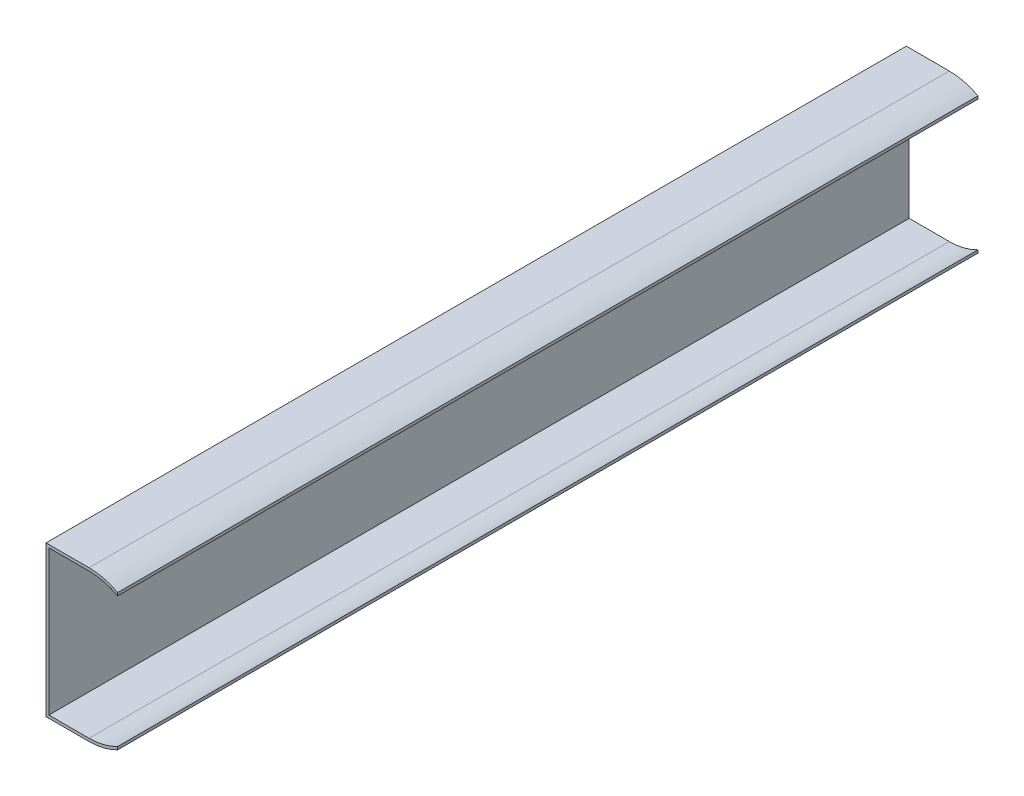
from build123d import *

# Parameters (mm, degrees)
EXTRUSION1_DEPTH = 600


with BuildPart() as part:
    # Esquisse1 → Extrusion1 (new body)
    with BuildSketch(Plane.XY):
        with BuildLine():
            Line((0, 0), (0, 105))
            Line((0, 105), (30, 105))
            add(Edge.make_bspline(
                [(30, 105), (40.603281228, 104.951543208), (50, 100)],
                knots=[0, 0, 0, 1, 1, 1], degree=2))
            Line((50, 100), (50, 98))
            add(Edge.make_bspline(
                [(30, 103), (40.603281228, 102.951543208), (50, 98)],
                knots=[0, 0, 0, 1, 1, 1], degree=2))
            Line((30, 103), (2, 103))
            Line((2, 103), (2, 2))
            Line((2, 2), (30, 2))
            add(Edge.make_bspline(
                [(30, 2), (40.603281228, 2.048456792), (50, 7)],
                knots=[0, 0, 0, 1, 1, 1], degree=2))
            Line((50, 7), (50, 5))
            add(Edge.make_bspline(
                [(30, 0), (40.603281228, 0.048456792), (50, 5)],
                knots=[0, 0, 0, 1, 1, 1], degree=2))
            Line((30, 0), (0, 0))
        make_face()
    extrude(amount=EXTRUSION1_DEPTH)


solid = part.part
